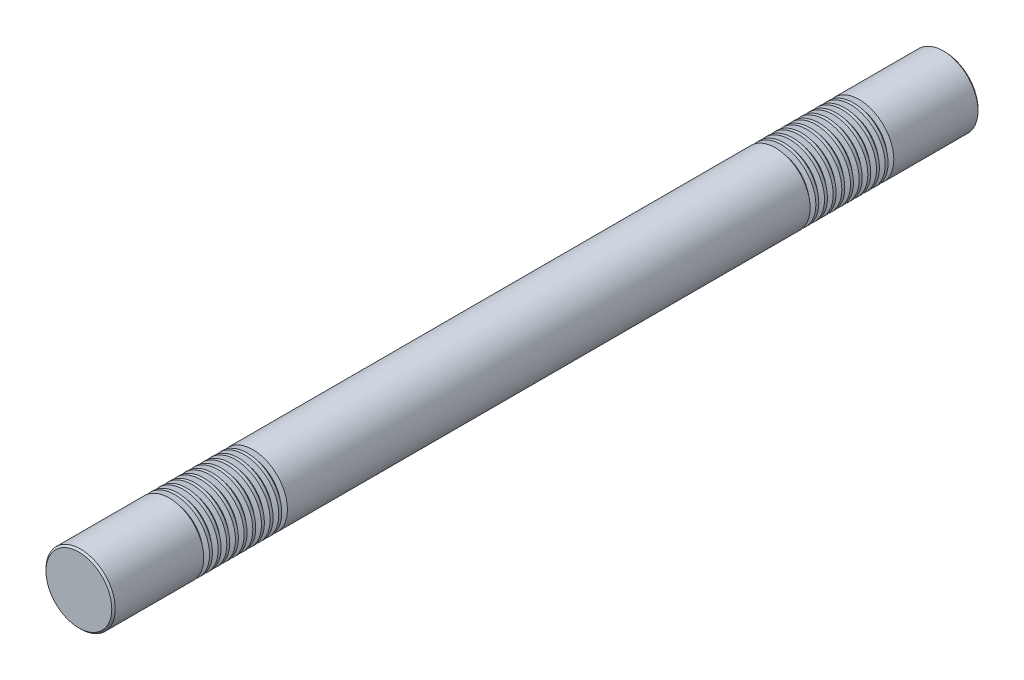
from build123d import *

# Parameters (mm, degrees)
SKETCH1_R           = 40
BOSS_EXTRUDE1_DEPTH = 500
CHAMFER1_SIZE       = 2
LPATTERN1_COUNT     = 10
LPATTERN1_PITCH     = 10
LPATTERN2_COUNT     = 2
LPATTERN2_PITCH     = 700


with BuildPart() as part:
    # Sketch1 → Boss-Extrude1 (new, symmetric)
    with BuildSketch(Plane.XY):
        Circle(SKETCH1_R)
    extrude(amount=BOSS_EXTRUDE1_DEPTH, both=True)

    # Chamfer1
    chamfer1_edges = [part.edges().sort_by_distance(p)[0] for p in [
        (-40, 0, -500),
        (-40, 0, 500),
    ]]
    chamfer(chamfer1_edges, length=CHAMFER1_SIZE)

    # Sketch2 → Cut-Revolve1 (revolve, cut)
    with BuildSketch(Plane(origin=(0, 0, 0), x_dir=(0, 0, -1), z_dir=(1, 0, 0)), mode=Mode.PRIVATE) as cut_revolve1_sk:
        Polygon((400.803847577, 40), (394.196152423, 40), (395.803847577, 34), (399.196152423, 34), align=None)
    cut_revolve1 = revolve(cut_revolve1_sk.sketch.rotate(Axis((0, 0, 500), (0, 0, -1)), 90), axis=Axis((0, 0, 500), (0, 0, -1)), mode=Mode.SUBTRACT)

    # LPattern1: Cut-Revolve1 ×10
    with Locations(*[(0, 0, i * LPATTERN1_PITCH) for i in range(1, LPATTERN1_COUNT)]):
        add(cut_revolve1, mode=Mode.SUBTRACT)

    # LPattern2: Cut-Revolve1 ×2
    with Locations(*[(0, 0, i * LPATTERN2_PITCH) for i in range(1, LPATTERN2_COUNT)]):
        add(cut_revolve1, mode=Mode.SUBTRACT)

    # LPattern2 copy 1 sketch → LPattern2 copy 1 (revolve, cut)
    with BuildSketch(Plane(origin=(0, 0, 710), x_dir=(0, 0, -1), z_dir=(1, 0, 0))):
        Polygon((400.803847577, 40), (394.196152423, 40), (395.803847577, 34), (399.196152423, 34), align=None)
    revolve(axis=Axis((0, 0, 1210), (0, 0, -1)), mode=Mode.SUBTRACT)

    # LPattern2 copy 2 sketch → LPattern2 copy 2 (revolve, cut)
    with BuildSketch(Plane(origin=(0, 0, 720), x_dir=(0, 0, -1), z_dir=(1, 0, 0))):
        Polygon((400.803847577, 40), (394.196152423, 40), (395.803847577, 34), (399.196152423, 34), align=None)
    revolve(axis=Axis((0, 0, 1220), (0, 0, -1)), mode=Mode.SUBTRACT)

    # LPattern2 copy 3 sketch → LPattern2 copy 3 (revolve, cut)
    with BuildSketch(Plane(origin=(0, 0, 730), x_dir=(0, 0, -1), z_dir=(1, 0, 0))):
        Polygon((400.803847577, 40), (394.196152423, 40), (395.803847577, 34), (399.196152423, 34), align=None)
    revolve(axis=Axis((0, 0, 1230), (0, 0, -1)), mode=Mode.SUBTRACT)

    # LPattern2 copy 4 sketch → LPattern2 copy 4 (revolve, cut)
    with BuildSketch(Plane(origin=(0, 0, 740), x_dir=(0, 0, -1), z_dir=(1, 0, 0))):
        Polygon((400.803847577, 40), (394.196152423, 40), (395.803847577, 34), (399.196152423, 34), align=None)
    revolve(axis=Axis((0, 0, 1240), (0, 0, -1)), mode=Mode.SUBTRACT)

    # LPattern2 copy 5 sketch → LPattern2 copy 5 (revolve, cut)
    with BuildSketch(Plane(origin=(0, 0, 750), x_dir=(0, 0, -1), z_dir=(1, 0, 0))):
        Polygon((400.803847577, 40), (394.196152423, 40), (395.803847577, 34), (399.196152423, 34), align=None)
    revolve(axis=Axis((0, 0, 1250), (0, 0, -1)), mode=Mode.SUBTRACT)

    # LPattern2 copy 6 sketch → LPattern2 copy 6 (revolve, cut)
    with BuildSketch(Plane(origin=(0, 0, 760), x_dir=(0, 0, -1), z_dir=(1, 0, 0))):
        Polygon((400.803847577, 40), (394.196152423, 40), (395.803847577, 34), (399.196152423, 34), align=None)
    revolve(axis=Axis((0, 0, 1260), (0, 0, -1)), mode=Mode.SUBTRACT)

    # LPattern2 copy 7 sketch → LPattern2 copy 7 (revolve, cut)
    with BuildSketch(Plane(origin=(0, 0, 770), x_dir=(0, 0, -1), z_dir=(1, 0, 0))):
        Polygon((400.803847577, 40), (394.196152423, 40), (395.803847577, 34), (399.196152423, 34), align=None)
    revolve(axis=Axis((0, 0, 1270), (0, 0, -1)), mode=Mode.SUBTRACT)

    # LPattern2 copy 8 sketch → LPattern2 copy 8 (revolve, cut)
    with BuildSketch(Plane(origin=(0, 0, 780), x_dir=(0, 0, -1), z_dir=(1, 0, 0))):
        Polygon((400.803847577, 40), (394.196152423, 40), (395.803847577, 34), (399.196152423, 34), align=None)
    revolve(axis=Axis((0, 0, 1280), (0, 0, -1)), mode=Mode.SUBTRACT)

    # LPattern2 copy 9 sketch → LPattern2 copy 9 (revolve, cut)
    with BuildSketch(Plane(origin=(0, 0, 790), x_dir=(0, 0, -1), z_dir=(1, 0, 0))):
        Polygon((400.803847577, 40), (394.196152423, 40), (395.803847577, 34), (399.196152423, 34), align=None)
    revolve(axis=Axis((0, 0, 1290), (0, 0, -1)), mode=Mode.SUBTRACT)


solid = part.part
